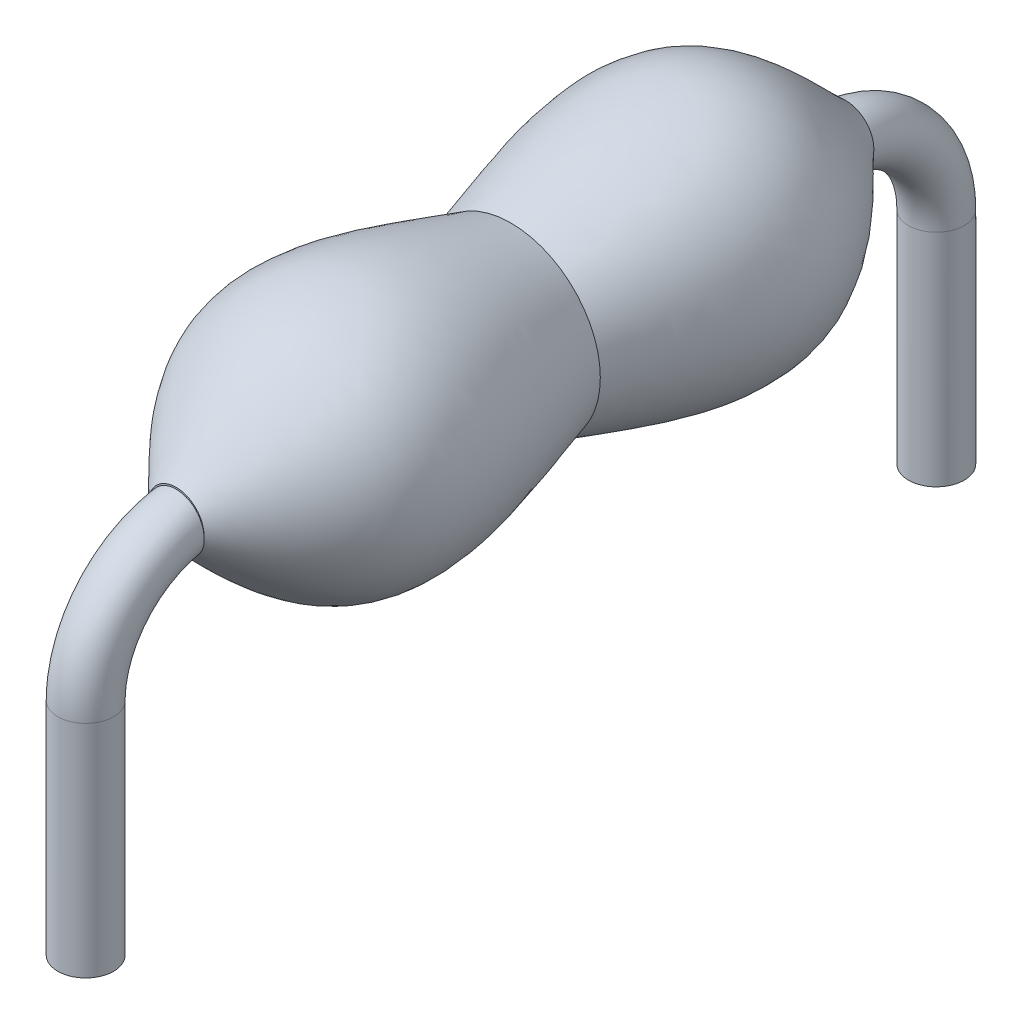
ISO-10303-21;
HEADER;
FILE_DESCRIPTION(('STEP AP214'),'2;1');
FILE_NAME('part.step','',(''),(''),'','','');
FILE_SCHEMA(('AUTOMOTIVE_DESIGN { 1 0 10303 214 1 1 1 1 }'));
ENDSEC;
DATA;
#1=APPLICATION_CONTEXT('core data for automotive mechanical design processes');
#2=APPLICATION_PROTOCOL_DEFINITION('international standard','automotive_design',2000,#1);
#3=PRODUCT_CONTEXT('',#1,'mechanical');
#4=PRODUCT('Part','Part','',(#3));
#5=PRODUCT_RELATED_PRODUCT_CATEGORY('part','',(#4));
#6=PRODUCT_DEFINITION_FORMATION('','',#4);
#7=PRODUCT_DEFINITION_CONTEXT('part definition',#1,'design');
#8=PRODUCT_DEFINITION('design','',#6,#7);
#9=PRODUCT_DEFINITION_SHAPE('','',#8);
#10=(LENGTH_UNIT() NAMED_UNIT(*) SI_UNIT(.MILLI.,.METRE.));
#11=(NAMED_UNIT(*) PLANE_ANGLE_UNIT() SI_UNIT($,.RADIAN.));
#12=(NAMED_UNIT(*) SI_UNIT($,.STERADIAN.) SOLID_ANGLE_UNIT());
#13=UNCERTAINTY_MEASURE_WITH_UNIT(LENGTH_MEASURE(1.E-05),#10,'distance_accuracy_value','');
#14=(GEOMETRIC_REPRESENTATION_CONTEXT(3) GLOBAL_UNCERTAINTY_ASSIGNED_CONTEXT((#13)) GLOBAL_UNIT_ASSIGNED_CONTEXT((#10,
#11,#12)) REPRESENTATION_CONTEXT('',''));
#15=CARTESIAN_POINT('',(0.,0.,0.));
#16=DIRECTION('',(0.,0.,1.));
#17=DIRECTION('',(1.,0.,0.));
#18=AXIS2_PLACEMENT_3D('',#15,#16,#17);
#19=CARTESIAN_POINT('',(0.,0.,-3.));
#20=DIRECTION('',(0.,0.,-1.));
#21=DIRECTION('',(1.,0.,0.));
#22=AXIS2_PLACEMENT_3D('',#19,#20,#21);
#23=PLANE('',#22);
#24=CARTESIAN_POINT('',(0.,0.,-3.));
#25=DIRECTION('',(0.,0.,1.));
#26=DIRECTION('',(1.,0.,0.));
#27=AXIS2_PLACEMENT_3D('',#24,#25,#26);
#28=CIRCLE('',#27,0.25);
#29=CARTESIAN_POINT('',(0.249837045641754,-0.0090249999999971,-3.));
#30=VERTEX_POINT('',#29);
#31=CARTESIAN_POINT('',(-0.249837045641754,-0.00902499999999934,-3.));
#32=VERTEX_POINT('',#31);
#33=EDGE_CURVE('E66',#30,#32,#28,.T.);
#34=ORIENTED_EDGE('',*,*,#33,.F.);
#35=CARTESIAN_POINT('',(-0.187387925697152,-0.187403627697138,-3.));
#36=CARTESIAN_POINT('',(-0.178201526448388,-0.198085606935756,-3.));
#37=CARTESIAN_POINT('',(-0.168126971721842,-0.208015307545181,-3.));
#38=CARTESIAN_POINT('',(-0.146457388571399,-0.22606669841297,-3.));
#39=CARTESIAN_POINT('',(-0.134860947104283,-0.234186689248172,-3.));
#40=CARTESIAN_POINT('',(-0.110449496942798,-0.248356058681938,-3.));
#41=CARTESIAN_POINT('',(-0.0976335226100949,-0.254403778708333,-3.));
#42=CARTESIAN_POINT('',(-0.0711554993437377,-0.264206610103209,-3.));
#43=CARTESIAN_POINT('',(-0.0574937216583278,-0.267962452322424,-3.));
#44=CARTESIAN_POINT('',(-0.0300151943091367,-0.272992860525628,-3.));
#45=CARTESIAN_POINT('',(-0.016207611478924,-0.274317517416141,-3.));
#46=CARTESIAN_POINT('',(0.011430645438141,-0.274590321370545,-3.));
#47=CARTESIAN_POINT('',(0.0252613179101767,-0.273538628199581,-3.));
#48=CARTESIAN_POINT('',(0.0523347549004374,-0.269131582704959,-3.));
#49=CARTESIAN_POINT('',(0.0655832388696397,-0.265811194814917,-3.));
#50=CARTESIAN_POINT('',(0.0913447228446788,-0.257018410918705,-3.));
#51=CARTESIAN_POINT('',(0.103857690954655,-0.251545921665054,-3.));
#52=CARTESIAN_POINT('',(0.12795745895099,-0.23855204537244,-3.));
#53=CARTESIAN_POINT('',(0.139531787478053,-0.231007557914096,-3.));
#54=CARTESIAN_POINT('',(0.161294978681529,-0.214132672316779,-3.));
#55=CARTESIAN_POINT('',(0.17148365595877,-0.204802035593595,-3.));
#56=CARTESIAN_POINT('',(0.19049068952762,-0.18433911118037,-3.));
#57=CARTESIAN_POINT('',(0.19926243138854,-0.173163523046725,-3.));
#58=CARTESIAN_POINT('',(0.214859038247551,-0.149527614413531,-3.));
#59=CARTESIAN_POINT('',(0.221683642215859,-0.137067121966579,-3.));
#60=CARTESIAN_POINT('',(0.23335615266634,-0.110885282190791,-3.));
#61=CARTESIAN_POINT('',(0.238151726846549,-0.0971405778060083,-3.));
#62=CARTESIAN_POINT('',(0.24539056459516,-0.0690446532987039,-3.));
#63=CARTESIAN_POINT('',(0.247833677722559,-0.054693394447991,-3.));
#64=CARTESIAN_POINT('',(0.250305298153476,-0.0256558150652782,-3.));
#65=CARTESIAN_POINT('',(0.250312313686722,-0.0109676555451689,-3.));
#66=CARTESIAN_POINT('',(0.247845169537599,0.0181993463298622,-3.));
#67=CARTESIAN_POINT('',(0.245371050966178,0.0326781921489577,-3.));
#68=CARTESIAN_POINT('',(0.238018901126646,0.060920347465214,-3.));
#69=CARTESIAN_POINT('',(0.233155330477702,0.0746874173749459,-3.));
#70=CARTESIAN_POINT('',(0.221154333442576,0.101192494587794,-3.));
#71=CARTESIAN_POINT('',(0.214017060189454,0.113930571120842,-3.));
#72=CARTESIAN_POINT('',(0.19777438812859,0.137828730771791,-3.));
#73=CARTESIAN_POINT('',(0.188697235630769,0.149008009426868,-3.));
#74=CARTESIAN_POINT('',(0.168769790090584,0.169655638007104,-3.));
#75=CARTESIAN_POINT('',(0.157919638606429,0.179124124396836,-3.));
#76=CARTESIAN_POINT('',(0.134924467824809,0.195937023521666,-3.));
#77=CARTESIAN_POINT('',(0.122800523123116,0.203310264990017,-3.));
#78=CARTESIAN_POINT('',(0.0974763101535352,0.215890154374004,-3.));
#79=CARTESIAN_POINT('',(0.0842761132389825,0.221096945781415,-3.));
#80=CARTESIAN_POINT('',(0.0573316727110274,0.22913975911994,-3.));
#81=CARTESIAN_POINT('',(0.043595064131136,0.232001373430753,-3.));
#82=CARTESIAN_POINT('',(0.0158360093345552,0.235363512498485,-3.));
#83=CARTESIAN_POINT('',(0.00181357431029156,0.235864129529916,-3.));
#84=CARTESIAN_POINT('',(-0.0260363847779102,0.234493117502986,-3.));
#85=CARTESIAN_POINT('',(-0.0398645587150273,0.232634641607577,-3.));
#86=CARTESIAN_POINT('',(-0.067012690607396,0.22662379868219,-3.));
#87=CARTESIAN_POINT('',(-0.0803326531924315,0.222471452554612,-3.));
#88=CARTESIAN_POINT('',(-0.1060981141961,0.211993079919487,-3.));
#89=CARTESIAN_POINT('',(-0.118543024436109,0.205665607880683,-3.));
#90=CARTESIAN_POINT('',(-0.142203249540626,0.191024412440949,-3.));
#91=CARTESIAN_POINT('',(-0.153418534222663,0.182710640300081,-3.));
#92=CARTESIAN_POINT('',(-0.174384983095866,0.164276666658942,-3.));
#93=CARTESIAN_POINT('',(-0.184125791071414,0.154144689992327,-3.));
#94=CARTESIAN_POINT('',(-0.20179175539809,0.132405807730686,-3.));
#95=CARTESIAN_POINT('',(-0.209716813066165,0.120798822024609,-3.));
#96=CARTESIAN_POINT('',(-0.223628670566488,0.0962945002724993,-3.));
#97=CARTESIAN_POINT('',(-0.229591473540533,0.0833835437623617,-3.));
#98=CARTESIAN_POINT('',(-0.239299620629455,0.056754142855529,-3.));
#99=CARTESIAN_POINT('',(-0.243044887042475,0.0430356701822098,-3.));
#100=CARTESIAN_POINT('',(-0.248269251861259,0.014968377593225,-3.));
#101=CARTESIAN_POINT('',(-0.249714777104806,0.000613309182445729,-3.));
#102=CARTESIAN_POINT('',(-0.250208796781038,-0.02814178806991,-3.));
#103=CARTESIAN_POINT('',(-0.249256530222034,-0.0425418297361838,-3.));
#104=CARTESIAN_POINT('',(-0.244960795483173,-0.071177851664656,-3.));
#105=CARTESIAN_POINT('',(-0.241585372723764,-0.085409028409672,-3.));
#106=CARTESIAN_POINT('',(-0.2325056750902,-0.113096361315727,-3.));
#107=CARTESIAN_POINT('',(-0.226803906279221,-0.126553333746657,-3.));
#108=CARTESIAN_POINT('',(-0.215502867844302,-0.148006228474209,-3.));
#109=CARTESIAN_POINT('',(-0.210505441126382,-0.156324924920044,-3.));
#110=CARTESIAN_POINT('',(-0.199608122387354,-0.172348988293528,-3.));
#111=CARTESIAN_POINT('',(-0.193708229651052,-0.180054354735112,-3.));
#112=CARTESIAN_POINT('',(-0.187387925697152,-0.187403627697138,-3.));
#113=B_SPLINE_CURVE_WITH_KNOTS('',3,(#35,#36,#37,#38,#39,#40,#41,#42,#43,#44,#45,#46,#47,#48,
#49,#50,#51,#52,#53,#54,#55,#56,#57,#58,#59,#60,#61,#62,#63,#64,#65,#66,#67,#68,#69,#70,#71,#72,
#73,#74,#75,#76,#77,#78,#79,#80,#81,#82,#83,#84,#85,#86,#87,#88,#89,#90,#91,#92,#93,#94,#95,#96,
#97,#98,#99,#100,#101,#102,#103,#104,#105,#106,#107,#108,#109,#110,#111,#112),.UNSPECIFIED.,.T.,
.F.,(4,2,2,2,2,2,2,2,2,2,2,2,2,2,2,2,2,2,2,2,2,2,2,2,2,2,2,2,2,2,2,2,2,2,2,2,2,2,4),(0.,
0.0422323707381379,0.0845042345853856,0.126809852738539,0.169101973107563,0.210512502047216,
0.251920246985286,0.292703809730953,0.333489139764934,0.374749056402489,0.416014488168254,
0.458440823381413,0.500872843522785,0.544340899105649,0.587811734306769,0.63166606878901,
0.675519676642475,0.719111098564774,0.762699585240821,0.805692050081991,0.848681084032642,
0.891046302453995,0.933408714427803,0.975302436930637,1.01719452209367,1.05885405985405,
1.10051321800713,1.14220011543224,1.18388803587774,1.22585637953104,1.26782700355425,
1.31029331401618,1.35276111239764,1.39584337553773,1.4389393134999,1.48261425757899,
1.526242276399,1.55529840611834,1.58435455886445),.UNSPECIFIED.);
#114=EDGE_CURVE('E50',#30,#32,#113,.T.);
#115=ORIENTED_EDGE('',*,*,#114,.T.);
#116=EDGE_LOOP('',(#34,#115));
#117=FACE_BOUND('',#116,.T.);
#118=ADVANCED_FACE('F31',(#117),#23,.T.);
#119=CARTESIAN_POINT('',(-0.537293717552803,0.592718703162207,0.));
#120=CARTESIAN_POINT('',(-0.534870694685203,0.875530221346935,-0.710765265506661));
#121=CARTESIAN_POINT('',(-0.530900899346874,1.33887865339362,-1.8752580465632));
#122=CARTESIAN_POINT('',(-0.284994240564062,0.493013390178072,-2.68463726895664));
#123=CARTESIAN_POINT('',(-0.189180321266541,0.163434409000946,-3.));
#124=CARTESIAN_POINT('',(-1.72273112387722,-0.4818687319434,0.));
#125=CARTESIAN_POINT('',(-2.28593113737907,-0.194211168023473,-0.710765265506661));
#126=CARTESIAN_POINT('',(-3.20865820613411,0.27707685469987,-1.8752580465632));
#127=CARTESIAN_POINT('',(-1.27102102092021,-0.0769750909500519,-2.68463726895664));
#128=CARTESIAN_POINT('',(-0.516049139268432,-0.214926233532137,-3.));
#129=CARTESIAN_POINT('',(-0.64814368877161,-1.66730613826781,0.));
#130=CARTESIAN_POINT('',(-1.21618974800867,-1.94527161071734,-0.710765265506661));
#131=CARTESIAN_POINT('',(-2.14685640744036,-2.40068045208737,-1.8752580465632));
#132=CARTESIAN_POINT('',(-0.701032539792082,-1.0630018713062,-2.68463726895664));
#133=CARTESIAN_POINT('',(-0.13768849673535,-0.541795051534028,-3.));
#134=CARTESIAN_POINT('',(0.537293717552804,-0.592718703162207,0.));
#135=CARTESIAN_POINT('',(0.534870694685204,-0.875530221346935,-0.710765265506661));
#136=CARTESIAN_POINT('',(0.530900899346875,-1.33887865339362,-1.8752580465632));
#137=CARTESIAN_POINT('',(0.284994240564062,-0.493013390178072,-2.68463726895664));
#138=CARTESIAN_POINT('',(0.189180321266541,-0.163434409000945,-3.));
#139=CARTESIAN_POINT('',(1.72273112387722,0.4818687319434,0.));
#140=CARTESIAN_POINT('',(2.28593113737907,0.194211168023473,-0.710765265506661));
#141=CARTESIAN_POINT('',(3.20865820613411,-0.277076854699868,-1.8752580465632));
#142=CARTESIAN_POINT('',(1.27102102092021,0.0769750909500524,-2.68463726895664));
#143=CARTESIAN_POINT('',(0.516049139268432,0.214926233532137,-3.));
#144=CARTESIAN_POINT('',(0.64814368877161,1.66730613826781,0.));
#145=CARTESIAN_POINT('',(1.21618974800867,1.94527161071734,-0.710765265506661));
#146=CARTESIAN_POINT('',(2.14685640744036,2.40068045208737,-1.8752580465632));
#147=CARTESIAN_POINT('',(0.701032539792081,1.0630018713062,-2.68463726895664));
#148=CARTESIAN_POINT('',(0.13768849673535,0.541795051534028,-3.));
#149=CARTESIAN_POINT('',(-0.537293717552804,0.592718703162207,0.));
#150=CARTESIAN_POINT('',(-0.534870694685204,0.875530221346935,-0.710765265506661));
#151=CARTESIAN_POINT('',(-0.530900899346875,1.33887865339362,-1.8752580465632));
#152=CARTESIAN_POINT('',(-0.284994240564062,0.493013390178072,-2.68463726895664));
#153=CARTESIAN_POINT('',(-0.189180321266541,0.163434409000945,-3.));
#154=(BOUNDED_SURFACE() B_SPLINE_SURFACE(3,3,((#119,#120,#121,#122,#123),(#124,#125,#126,#127,
#128),(#129,#130,#131,#132,#133),(#134,#135,#136,#137,#138),(#139,#140,#141,#142,#143),(#144,
#145,#146,#147,#148),(#149,#150,#151,#152,#153)),.UNSPECIFIED.,.T.,.F.,
.F.) B_SPLINE_SURFACE_WITH_KNOTS((4,3,4),(4,1,4),(0.,0.5,1.),(0.,0.610364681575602,1.),
.UNSPECIFIED.) GEOMETRIC_REPRESENTATION_ITEM() RATIONAL_B_SPLINE_SURFACE(((1.,1.,1.,1.,1.),
(0.333333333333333,0.333333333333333,0.333333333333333,0.333333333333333,0.333333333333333),
(0.333333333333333,0.333333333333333,0.333333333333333,0.333333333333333,0.333333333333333),(1.,
1.,1.,1.,1.),(0.333333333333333,0.333333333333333,0.333333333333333,0.333333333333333,
0.333333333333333),(0.333333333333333,0.333333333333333,0.333333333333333,0.333333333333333,
0.333333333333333),(1.,1.,1.,1.,1.))) REPRESENTATION_ITEM('') SURFACE());
#155=CARTESIAN_POINT('',(0.,0.,0.));
#156=DIRECTION('',(0.,0.,1.));
#157=DIRECTION('',(1.,0.,0.));
#158=AXIS2_PLACEMENT_3D('',#155,#156,#157);
#159=CIRCLE('',#158,0.8);
#160=CARTESIAN_POINT('',(0.8,0.,0.));
#161=VERTEX_POINT('',#160);
#162=EDGE_CURVE('E71',#161,#161,#159,.T.);
#163=CARTESIAN_POINT('',(-0.249837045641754,-0.00902499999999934,-3.));
#164=CARTESIAN_POINT('',(-0.250358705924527,-0.0232229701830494,-2.9988791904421));
#165=CARTESIAN_POINT('',(-0.249656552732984,-0.0374599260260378,-2.99775702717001));
#166=CARTESIAN_POINT('',(-0.245876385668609,-0.0656079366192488,-2.99553775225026));
#167=CARTESIAN_POINT('',(-0.242799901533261,-0.0795191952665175,-2.99444062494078));
#168=CARTESIAN_POINT('',(-0.23434147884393,-0.106637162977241,-2.99229719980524));
#169=CARTESIAN_POINT('',(-0.228958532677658,-0.119843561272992,-2.99125092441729));
#170=CARTESIAN_POINT('',(-0.216059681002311,-0.14515575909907,-2.98923847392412));
#171=CARTESIAN_POINT('',(-0.208544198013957,-0.157261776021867,-2.98827228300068));
#172=CARTESIAN_POINT('',(-0.183082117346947,-0.191373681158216,-2.98553701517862));
#173=CARTESIAN_POINT('',(-0.162179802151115,-0.211299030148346,-2.9839213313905));
#174=CARTESIAN_POINT('',(-0.115078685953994,-0.242875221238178,-2.98134049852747));
#175=CARTESIAN_POINT('',(-0.0889161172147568,-0.254580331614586,-2.98037108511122));
#176=CARTESIAN_POINT('',(-0.0344091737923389,-0.268509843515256,-2.97921536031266));
#177=CARTESIAN_POINT('',(-0.00608762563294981,-0.27082234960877,-2.9790217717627));
#178=CARTESIAN_POINT('',(0.0495365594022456,-0.26591824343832,-2.97942995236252));
#179=CARTESIAN_POINT('',(0.0768442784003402,-0.258758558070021,-2.98002697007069));
#180=CARTESIAN_POINT('',(0.127609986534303,-0.235876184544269,-2.98191324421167));
#181=CARTESIAN_POINT('',(0.151060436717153,-0.220136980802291,-2.98320383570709));
#182=CARTESIAN_POINT('',(0.191691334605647,-0.181671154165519,-2.98631794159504));
#183=CARTESIAN_POINT('',(0.208818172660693,-0.158887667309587,-2.98814578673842));
#184=CARTESIAN_POINT('',(0.228241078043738,-0.121472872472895,-2.99112182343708));
#185=CARTESIAN_POINT('',(0.23368478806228,-0.108368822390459,-2.99216013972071));
#186=CARTESIAN_POINT('',(0.242305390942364,-0.0814296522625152,-2.99428978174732));
#187=CARTESIAN_POINT('',(0.245484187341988,-0.0675951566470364,-2.99538106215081));
#188=CARTESIAN_POINT('',(0.248533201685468,-0.0462223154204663,-2.99706618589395));
#189=CARTESIAN_POINT('',(0.249256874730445,-0.0387940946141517,-2.99765171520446));
#190=CARTESIAN_POINT('',(0.250042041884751,-0.0239162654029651,-2.99882485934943));
#191=CARTESIAN_POINT('',(0.250104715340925,-0.016466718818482,-2.99941246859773));
#192=CARTESIAN_POINT('',(0.249837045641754,-0.00902499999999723,-3.));
#193=B_SPLINE_CURVE_WITH_KNOTS('',3,(#163,#164,#165,#166,#167,#168,#169,#170,#171,#172,#173,
#174,#175,#176,#177,#178,#179,#180,#181,#182,#183,#184,#185,#186,#187,#188,#189,#190,#191,#192),
.UNSPECIFIED.,.F.,.F.,(4,2,2,2,2,2,2,2,2,2,2,2,2,2,4),(0.,0.0426957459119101,0.0853640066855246,
0.128050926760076,0.170729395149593,0.255708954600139,0.340122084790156,0.423741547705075,
0.506860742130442,0.59014050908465,0.67411091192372,0.7166324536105,0.759118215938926,
0.781551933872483,0.803945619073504),.UNSPECIFIED.);
#194=EDGE_CURVE('E11',#32,#30,#193,.T.);
#195=ORIENTED_EDGE('',*,*,#162,.F.);
#196=EDGE_LOOP('',(#195));
#197=FACE_BOUND('',#196,.T.);
#198=ORIENTED_EDGE('',*,*,#33,.T.);
#199=ORIENTED_EDGE('',*,*,#194,.T.);
#200=EDGE_LOOP('',(#198,#199));
#201=FACE_BOUND('',#200,.T.);
#202=ADVANCED_FACE('F70',(#197,#201),#154,.F.);
#203=CARTESIAN_POINT('',(0.,0.,3.));
#204=DIRECTION('',(0.,0.,1.));
#205=DIRECTION('',(1.,0.,0.));
#206=AXIS2_PLACEMENT_3D('',#203,#204,#205);
#207=PLANE('',#206);
#208=CARTESIAN_POINT('',(-0.170610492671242,-0.205127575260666,3.));
#209=CARTESIAN_POINT('',(-0.160529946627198,-0.214803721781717,3.));
#210=CARTESIAN_POINT('',(-0.149644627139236,-0.22365373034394,3.));
#211=CARTESIAN_POINT('',(-0.126543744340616,-0.239423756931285,3.));
#212=CARTESIAN_POINT('',(-0.114327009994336,-0.246342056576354,3.));
#213=CARTESIAN_POINT('',(-0.0888868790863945,-0.258018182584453,3.));
#214=CARTESIAN_POINT('',(-0.0756627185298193,-0.262774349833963,3.));
#215=CARTESIAN_POINT('',(-0.0485971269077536,-0.269947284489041,3.));
#216=CARTESIAN_POINT('',(-0.0347558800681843,-0.272364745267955,3.));
#217=CARTESIAN_POINT('',(-0.00713167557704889,-0.274749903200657,3.));
#218=CARTESIAN_POINT('',(0.00664731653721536,-0.274763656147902,3.));
#219=CARTESIAN_POINT('',(0.0340079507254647,-0.272456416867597,3.));
#220=CARTESIAN_POINT('',(0.0475895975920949,-0.270135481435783,3.));
#221=CARTESIAN_POINT('',(0.0740605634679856,-0.263270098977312,3.));
#222=CARTESIAN_POINT('',(0.0869545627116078,-0.25874364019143,3.));
#223=CARTESIAN_POINT('',(0.11181940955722,-0.247627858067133,3.));
#224=CARTESIAN_POINT('',(0.123790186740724,-0.241038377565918,3.));
#225=CARTESIAN_POINT('',(0.146706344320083,-0.225867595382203,3.));
#226=CARTESIAN_POINT('',(0.157629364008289,-0.217252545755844,3.));
#227=CARTESIAN_POINT('',(0.177925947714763,-0.198358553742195,3.));
#228=CARTESIAN_POINT('',(0.187299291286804,-0.188079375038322,3.));
#229=CARTESIAN_POINT('',(0.204515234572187,-0.165827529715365,3.));
#230=CARTESIAN_POINT('',(0.212305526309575,-0.15381437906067,3.));
#231=CARTESIAN_POINT('',(0.225807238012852,-0.128671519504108,3.));
#232=CARTESIAN_POINT('',(0.2315184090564,-0.115541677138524,3.));
#233=CARTESIAN_POINT('',(0.240810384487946,-0.0882432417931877,3.));
#234=CARTESIAN_POINT('',(0.244344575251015,-0.0740587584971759,3.));
#235=CARTESIAN_POINT('',(0.248993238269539,-0.0452981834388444,3.));
#236=CARTESIAN_POINT('',(0.250107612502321,-0.0307220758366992,3.));
#237=CARTESIAN_POINT('',(0.249875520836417,-0.00152640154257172,3.));
#238=CARTESIAN_POINT('',(0.248518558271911,0.0130930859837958,3.));
#239=CARTESIAN_POINT('',(0.243347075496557,0.0418912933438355,3.));
#240=CARTESIAN_POINT('',(0.239532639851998,0.0560700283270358,3.));
#241=CARTESIAN_POINT('',(0.229584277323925,0.0834470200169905,3.));
#242=CARTESIAN_POINT('',(0.22347123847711,0.0966528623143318,3.));
#243=CARTESIAN_POINT('',(0.209083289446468,0.121829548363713,3.));
#244=CARTESIAN_POINT('',(0.200808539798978,0.133800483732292,3.));
#245=CARTESIAN_POINT('',(0.182460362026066,0.155981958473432,3.));
#246=CARTESIAN_POINT('',(0.172414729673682,0.166215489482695,3.));
#247=CARTESIAN_POINT('',(0.150726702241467,0.184821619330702,3.));
#248=CARTESIAN_POINT('',(0.139084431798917,0.193194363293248,3.));
#249=CARTESIAN_POINT('',(0.114708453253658,0.207720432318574,3.));
#250=CARTESIAN_POINT('',(0.101992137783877,0.213902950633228,3.));
#251=CARTESIAN_POINT('',(0.0756950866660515,0.224021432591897,3.));
#252=CARTESIAN_POINT('',(0.0621144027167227,0.227957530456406,3.));
#253=CARTESIAN_POINT('',(0.0346156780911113,0.233436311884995,3.));
#254=CARTESIAN_POINT('',(0.0207021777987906,0.235001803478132,3.));
#255=CARTESIAN_POINT('',(-0.00718940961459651,0.235764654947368,3.));
#256=CARTESIAN_POINT('',(-0.021167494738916,0.234962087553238,3.));
#257=CARTESIAN_POINT('',(-0.0487346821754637,0.231020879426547,3.));
#258=CARTESIAN_POINT('',(-0.0623250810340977,0.227891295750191,3.));
#259=CARTESIAN_POINT('',(-0.0887893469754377,0.21940010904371,3.));
#260=CARTESIAN_POINT('',(-0.10166321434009,0.214038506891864,3.));
#261=CARTESIAN_POINT('',(-0.12636445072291,0.201226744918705,3.));
#262=CARTESIAN_POINT('',(-0.138189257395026,0.193771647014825,3.));
#263=CARTESIAN_POINT('',(-0.160432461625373,0.176997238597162,3.));
#264=CARTESIAN_POINT('',(-0.170850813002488,0.167677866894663,3.));
#265=CARTESIAN_POINT('',(-0.190080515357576,0.147360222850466,3.));
#266=CARTESIAN_POINT('',(-0.198877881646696,0.136348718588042,3.));
#267=CARTESIAN_POINT('',(-0.214526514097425,0.113020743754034,3.));
#268=CARTESIAN_POINT('',(-0.221377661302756,0.100704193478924,3.));
#269=CARTESIAN_POINT('',(-0.233035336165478,0.074947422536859,3.));
#270=CARTESIAN_POINT('',(-0.23781440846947,0.0614947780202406,3.));
#271=CARTESIAN_POINT('',(-0.245082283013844,0.0339852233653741,3.));
#272=CARTESIAN_POINT('',(-0.247570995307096,0.0199282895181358,3.));
#273=CARTESIAN_POINT('',(-0.250224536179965,-0.00860997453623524,3.));
#274=CARTESIAN_POINT('',(-0.250354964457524,-0.0230945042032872,3.));
#275=CARTESIAN_POINT('',(-0.248211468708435,-0.0518885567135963,3.));
#276=CARTESIAN_POINT('',(-0.245936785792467,-0.0661980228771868,3.));
#277=CARTESIAN_POINT('',(-0.239009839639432,-0.0944093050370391,3.));
#278=CARTESIAN_POINT('',(-0.234329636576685,-0.108304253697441,3.));
#279=CARTESIAN_POINT('',(-0.222707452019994,-0.135101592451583,3.));
#280=CARTESIAN_POINT('',(-0.215767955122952,-0.148005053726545,3.));
#281=CARTESIAN_POINT('',(-0.202474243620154,-0.168382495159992,3.));
#282=CARTESIAN_POINT('',(-0.196692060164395,-0.176235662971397,3.));
#283=CARTESIAN_POINT('',(-0.18427377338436,-0.191235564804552,3.));
#284=CARTESIAN_POINT('',(-0.177637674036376,-0.198382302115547,3.));
#285=CARTESIAN_POINT('',(-0.170610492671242,-0.205127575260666,3.));
#286=B_SPLINE_CURVE_WITH_KNOTS('',3,(#208,#209,#210,#211,#212,#213,#214,#215,#216,#217,#218,
#219,#220,#221,#222,#223,#224,#225,#226,#227,#228,#229,#230,#231,#232,#233,#234,#235,#236,#237,
#238,#239,#240,#241,#242,#243,#244,#245,#246,#247,#248,#249,#250,#251,#252,#253,#254,#255,#256,
#257,#258,#259,#260,#261,#262,#263,#264,#265,#266,#267,#268,#269,#270,#271,#272,#273,#274,#275,
#276,#277,#278,#279,#280,#281,#282,#283,#284,#285),.UNSPECIFIED.,.T.,.F.,(4,2,2,2,2,2,2,2,2,2,2,
2,2,2,2,2,2,2,2,2,2,2,2,2,2,2,2,2,2,2,2,2,2,2,2,2,2,2,4),(0.,0.0418848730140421,
0.0838068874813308,0.125761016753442,0.167702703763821,0.208840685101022,0.24997766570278,
0.290784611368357,0.331594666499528,0.373140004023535,0.414691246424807,0.457448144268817,
0.500210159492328,0.543858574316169,0.587508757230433,0.631344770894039,0.675179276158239,
0.718624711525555,0.762066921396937,0.804879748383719,0.84768923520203,0.889904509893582,
0.932117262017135,0.973921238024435,1.0157239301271,1.05736476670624,1.09900558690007,
1.14074546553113,1.1824867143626,1.22457274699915,1.2666613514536,1.30929175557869,
1.35192383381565,1.3951772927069,1.43844440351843,1.48222581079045,1.52595923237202,
1.55515744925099,1.58435553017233),.UNSPECIFIED.);
#287=CARTESIAN_POINT('',(0.249848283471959,-0.00901177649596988,3.));
#288=VERTEX_POINT('',#287);
#289=CARTESIAN_POINT('',(-0.249847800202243,-0.00901228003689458,2.9999999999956));
#290=VERTEX_POINT('',#289);
#291=EDGE_CURVE('E72',#288,#290,#286,.T.);
#292=ORIENTED_EDGE('',*,*,#291,.F.);
#293=CARTESIAN_POINT('',(-0.189180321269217,0.16343440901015,2.99999999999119));
#294=CARTESIAN_POINT('',(0.137688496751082,0.541795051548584,2.99999999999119));
#295=CARTESIAN_POINT('',(0.516049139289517,0.214926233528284,2.99999999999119));
#296=CARTESIAN_POINT('',(0.189180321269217,-0.16343440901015,2.99999999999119));
#297=CARTESIAN_POINT('',(-0.137688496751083,-0.541795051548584,2.99999999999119));
#298=CARTESIAN_POINT('',(-0.516049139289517,-0.214926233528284,2.99999999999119));
#299=CARTESIAN_POINT('',(-0.189180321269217,0.16343440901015,2.99999999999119));
#300=(BOUNDED_CURVE() B_SPLINE_CURVE(3,(#293,#294,#295,#296,#297,#298,#299),.UNSPECIFIED.,.T.,
.F.) B_SPLINE_CURVE_WITH_KNOTS((4,3,4),(0.,0.5,1.),
.UNSPECIFIED.) CURVE() GEOMETRIC_REPRESENTATION_ITEM() RATIONAL_B_SPLINE_CURVE((1.,
0.333333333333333,0.333333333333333,1.,0.333333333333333,0.333333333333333,1.)) REPRESENTATION_ITEM(''));
#301=EDGE_CURVE('E75',#288,#290,#300,.F.);
#302=ORIENTED_EDGE('',*,*,#301,.T.);
#303=EDGE_LOOP('',(#292,#302));
#304=FACE_BOUND('',#303,.T.);
#305=ADVANCED_FACE('F133',(#304),#207,.T.);
#306=CARTESIAN_POINT('',(-0.537293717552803,0.592718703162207,0.));
#307=CARTESIAN_POINT('',(-0.534870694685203,0.875530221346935,0.710765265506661));
#308=CARTESIAN_POINT('',(-0.530900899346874,1.33887865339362,1.8752580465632));
#309=CARTESIAN_POINT('',(-0.284994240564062,0.493013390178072,2.68463726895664));
#310=CARTESIAN_POINT('',(-0.189180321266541,0.163434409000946,3.));
#311=CARTESIAN_POINT('',(-1.72273112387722,-0.4818687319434,0.));
#312=CARTESIAN_POINT('',(-2.28593113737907,-0.194211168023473,0.710765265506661));
#313=CARTESIAN_POINT('',(-3.20865820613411,0.27707685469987,1.8752580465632));
#314=CARTESIAN_POINT('',(-1.27102102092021,-0.0769750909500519,2.68463726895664));
#315=CARTESIAN_POINT('',(-0.516049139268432,-0.214926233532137,3.));
#316=CARTESIAN_POINT('',(-0.64814368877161,-1.66730613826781,0.));
#317=CARTESIAN_POINT('',(-1.21618974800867,-1.94527161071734,0.710765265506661));
#318=CARTESIAN_POINT('',(-2.14685640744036,-2.40068045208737,1.8752580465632));
#319=CARTESIAN_POINT('',(-0.701032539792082,-1.0630018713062,2.68463726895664));
#320=CARTESIAN_POINT('',(-0.13768849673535,-0.541795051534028,3.));
#321=CARTESIAN_POINT('',(0.537293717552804,-0.592718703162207,0.));
#322=CARTESIAN_POINT('',(0.534870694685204,-0.875530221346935,0.710765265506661));
#323=CARTESIAN_POINT('',(0.530900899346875,-1.33887865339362,1.8752580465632));
#324=CARTESIAN_POINT('',(0.284994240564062,-0.493013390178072,2.68463726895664));
#325=CARTESIAN_POINT('',(0.189180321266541,-0.163434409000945,3.));
#326=CARTESIAN_POINT('',(1.72273112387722,0.4818687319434,0.));
#327=CARTESIAN_POINT('',(2.28593113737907,0.194211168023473,0.710765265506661));
#328=CARTESIAN_POINT('',(3.20865820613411,-0.277076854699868,1.8752580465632));
#329=CARTESIAN_POINT('',(1.27102102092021,0.0769750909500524,2.68463726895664));
#330=CARTESIAN_POINT('',(0.516049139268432,0.214926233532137,3.));
#331=CARTESIAN_POINT('',(0.64814368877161,1.66730613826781,0.));
#332=CARTESIAN_POINT('',(1.21618974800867,1.94527161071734,0.710765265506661));
#333=CARTESIAN_POINT('',(2.14685640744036,2.40068045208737,1.8752580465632));
#334=CARTESIAN_POINT('',(0.701032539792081,1.0630018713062,2.68463726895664));
#335=CARTESIAN_POINT('',(0.13768849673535,0.541795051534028,3.));
#336=CARTESIAN_POINT('',(-0.537293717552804,0.592718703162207,0.));
#337=CARTESIAN_POINT('',(-0.534870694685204,0.875530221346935,0.710765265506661));
#338=CARTESIAN_POINT('',(-0.530900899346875,1.33887865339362,1.8752580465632));
#339=CARTESIAN_POINT('',(-0.284994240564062,0.493013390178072,2.68463726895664));
#340=CARTESIAN_POINT('',(-0.189180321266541,0.163434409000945,3.));
#341=(BOUNDED_SURFACE() B_SPLINE_SURFACE(3,3,((#306,#307,#308,#309,#310),(#311,#312,#313,#314,
#315),(#316,#317,#318,#319,#320),(#321,#322,#323,#324,#325),(#326,#327,#328,#329,#330),(#331,
#332,#333,#334,#335),(#336,#337,#338,#339,#340)),.UNSPECIFIED.,.T.,.F.,
.F.) B_SPLINE_SURFACE_WITH_KNOTS((4,3,4),(4,1,4),(0.,0.5,1.),(0.,0.610364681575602,1.),
.UNSPECIFIED.) GEOMETRIC_REPRESENTATION_ITEM() RATIONAL_B_SPLINE_SURFACE(((1.,1.,1.,1.,1.),
(0.333333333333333,0.333333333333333,0.333333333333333,0.333333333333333,0.333333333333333),
(0.333333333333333,0.333333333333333,0.333333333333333,0.333333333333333,0.333333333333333),(1.,
1.,1.,1.,1.),(0.333333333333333,0.333333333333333,0.333333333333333,0.333333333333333,
0.333333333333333),(0.333333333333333,0.333333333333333,0.333333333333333,0.333333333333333,
0.333333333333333),(1.,1.,1.,1.,1.))) REPRESENTATION_ITEM('') SURFACE());
#342=CARTESIAN_POINT('',(-0.249837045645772,-0.00902500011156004,2.99999999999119));
#343=CARTESIAN_POINT('',(-0.250358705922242,-0.0232229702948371,2.99887919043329));
#344=CARTESIAN_POINT('',(-0.249656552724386,-0.0374599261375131,2.99775702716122));
#345=CARTESIAN_POINT('',(-0.245876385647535,-0.065607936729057,2.99553775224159));
#346=CARTESIAN_POINT('',(-0.242799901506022,-0.0795191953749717,2.99444062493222));
#347=CARTESIAN_POINT('',(-0.234341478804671,-0.106637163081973,2.99229719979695));
#348=CARTESIAN_POINT('',(-0.228958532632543,-0.119843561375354,2.99125092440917));
#349=CARTESIAN_POINT('',(-0.216059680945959,-0.145155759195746,2.98923847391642));
#350=CARTESIAN_POINT('',(-0.208544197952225,-0.157261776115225,2.98827228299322));
#351=CARTESIAN_POINT('',(-0.183082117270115,-0.191373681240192,2.985537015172));
#352=CARTESIAN_POINT('',(-0.162179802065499,-0.211299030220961,2.9839213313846));
#353=CARTESIAN_POINT('',(-0.115078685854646,-0.242875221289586,2.98134049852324));
#354=CARTESIAN_POINT('',(-0.0889161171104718,-0.254580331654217,2.98037108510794));
#355=CARTESIAN_POINT('',(-0.0344091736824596,-0.268509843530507,2.97921536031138));
#356=CARTESIAN_POINT('',(-0.00608762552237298,-0.270822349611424,2.97902177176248));
#357=CARTESIAN_POINT('',(0.0495365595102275,-0.265918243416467,2.97942995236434));
#358=CARTESIAN_POINT('',(0.0768442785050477,-0.258758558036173,2.98002697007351));
#359=CARTESIAN_POINT('',(0.127609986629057,-0.23587618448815,2.98191324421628));
#360=CARTESIAN_POINT('',(0.151060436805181,-0.220136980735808,2.98320383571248));
#361=CARTESIAN_POINT('',(0.191691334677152,-0.181671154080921,2.98631794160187));
#362=CARTESIAN_POINT('',(0.208818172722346,-0.158887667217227,2.98814578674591));
#363=CARTESIAN_POINT('',(0.228241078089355,-0.121472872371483,2.99112182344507));
#364=CARTESIAN_POINT('',(0.233684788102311,-0.108368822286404,2.9921601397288));
#365=CARTESIAN_POINT('',(0.242305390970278,-0.0814296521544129,2.994289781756));
#366=CARTESIAN_POINT('',(0.245484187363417,-0.0675951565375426,2.99538106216));
#367=CARTESIAN_POINT('',(0.248533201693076,-0.0462223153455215,2.99706618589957));
#368=CARTESIAN_POINT('',(0.249256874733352,-0.0387940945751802,2.99765171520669));
#369=CARTESIAN_POINT('',(0.250042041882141,-0.0239162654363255,2.99882485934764));
#370=CARTESIAN_POINT('',(0.250104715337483,-0.0164667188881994,2.99941246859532));
#371=CARTESIAN_POINT('',(0.249837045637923,-0.00902500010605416,3.));
#372=B_SPLINE_CURVE_WITH_KNOTS('',3,(#342,#343,#344,#345,#346,#347,#348,#349,#350,#351,#352,
#353,#354,#355,#356,#357,#358,#359,#360,#361,#362,#363,#364,#365,#366,#367,#368,#369,#370,#371),
.UNSPECIFIED.,.F.,.F.,(4,2,2,2,2,2,2,2,2,2,2,2,2,2,4),(0.,0.0426957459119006,0.0853640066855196,
0.128050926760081,0.170729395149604,0.25570895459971,0.34012208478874,0.423741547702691,
0.506860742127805,0.590140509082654,0.674110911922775,0.716632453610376,0.759118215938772,
0.781551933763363,0.803945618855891),.UNSPECIFIED.);
#373=EDGE_CURVE('E43',#290,#288,#372,.T.);
#374=ORIENTED_EDGE('',*,*,#373,.F.);
#375=ORIENTED_EDGE('',*,*,#301,.F.);
#376=EDGE_LOOP('',(#374,#375));
#377=FACE_BOUND('',#376,.T.);
#378=ORIENTED_EDGE('',*,*,#162,.T.);
#379=EDGE_LOOP('',(#378));
#380=FACE_BOUND('',#379,.T.);
#381=ADVANCED_FACE('F33',(#377,#380),#341,.T.);
#382=CARTESIAN_POINT('',(0.,-1.,3.81));
#383=DIRECTION('',(0.,-1.,0.));
#384=DIRECTION('',(0.,0.,-1.));
#385=AXIS2_PLACEMENT_3D('',#382,#383,#384);
#386=CYLINDRICAL_SURFACE('',#385,0.25);
#387=CARTESIAN_POINT('',(0.,-1.,3.81));
#388=DIRECTION('',(0.,-1.,0.));
#389=DIRECTION('',(1.,0.,0.));
#390=AXIS2_PLACEMENT_3D('',#387,#388,#389);
#391=CIRCLE('',#390,0.25);
#392=CARTESIAN_POINT('',(0.25,-1.,3.81));
#393=VERTEX_POINT('',#392);
#394=EDGE_CURVE('E67',#393,#393,#391,.T.);
#395=ORIENTED_EDGE('',*,*,#394,.T.);
#396=EDGE_LOOP('',(#395));
#397=FACE_BOUND('',#396,.T.);
#398=CARTESIAN_POINT('',(0.,-2.97515605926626,3.81));
#399=DIRECTION('',(0.,-1.,0.));
#400=DIRECTION('',(1.,0.,0.));
#401=AXIS2_PLACEMENT_3D('',#398,#399,#400);
#402=CIRCLE('',#401,0.25);
#403=CARTESIAN_POINT('',(0.25,-2.97515605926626,3.81));
#404=VERTEX_POINT('',#403);
#405=EDGE_CURVE('E78',#404,#404,#402,.T.);
#406=ORIENTED_EDGE('',*,*,#405,.F.);
#407=EDGE_LOOP('',(#406));
#408=FACE_BOUND('',#407,.T.);
#409=ADVANCED_FACE('F113',(#397,#408),#386,.T.);
#410=CARTESIAN_POINT('',(0.,-1.,2.81));
#411=DIRECTION('',(1.,0.,0.));
#412=DIRECTION('',(0.,0.,-1.));
#413=AXIS2_PLACEMENT_3D('',#410,#411,#412);
#414=TOROIDAL_SURFACE('',#413,1.,0.25);
#415=ORIENTED_EDGE('',*,*,#373,.T.);
#416=ORIENTED_EDGE('',*,*,#291,.T.);
#417=EDGE_LOOP('',(#415,#416));
#418=FACE_BOUND('',#417,.T.);
#419=ORIENTED_EDGE('',*,*,#394,.F.);
#420=EDGE_LOOP('',(#419));
#421=FACE_BOUND('',#420,.T.);
#422=ADVANCED_FACE('F116',(#418,#421),#414,.T.);
#423=CARTESIAN_POINT('',(0.,-2.97515605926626,3.81));
#424=DIRECTION('',(0.,-1.,0.));
#425=DIRECTION('',(1.,0.,0.));
#426=AXIS2_PLACEMENT_3D('',#423,#424,#425);
#427=PLANE('',#426);
#428=ORIENTED_EDGE('',*,*,#405,.T.);
#429=EDGE_LOOP('',(#428));
#430=FACE_BOUND('',#429,.T.);
#431=ADVANCED_FACE('F120',(#430),#427,.T.);
#432=CARTESIAN_POINT('',(0.,-1.,-3.81));
#433=DIRECTION('',(0.,-1.,0.));
#434=DIRECTION('',(0.,0.,-1.));
#435=AXIS2_PLACEMENT_3D('',#432,#433,#434);
#436=CYLINDRICAL_SURFACE('',#435,0.25);
#437=CARTESIAN_POINT('',(0.,-1.,-3.81));
#438=DIRECTION('',(0.,1.,0.));
#439=DIRECTION('',(0.,0.,1.));
#440=AXIS2_PLACEMENT_3D('',#437,#438,#439);
#441=CIRCLE('',#440,0.25);
#442=CARTESIAN_POINT('',(0.,-1.,-3.56));
#443=VERTEX_POINT('',#442);
#444=EDGE_CURVE('E169',#443,#443,#441,.T.);
#445=ORIENTED_EDGE('',*,*,#444,.F.);
#446=EDGE_LOOP('',(#445));
#447=FACE_BOUND('',#446,.T.);
#448=CARTESIAN_POINT('',(0.,-2.97515605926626,-3.81));
#449=DIRECTION('',(0.,-1.,0.));
#450=DIRECTION('',(0.,0.,-1.));
#451=AXIS2_PLACEMENT_3D('',#448,#449,#450);
#452=CIRCLE('',#451,0.25);
#453=CARTESIAN_POINT('',(0.,-2.97515605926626,-4.06));
#454=VERTEX_POINT('',#453);
#455=EDGE_CURVE('E68',#454,#454,#452,.F.);
#456=ORIENTED_EDGE('',*,*,#455,.T.);
#457=EDGE_LOOP('',(#456));
#458=FACE_BOUND('',#457,.T.);
#459=ADVANCED_FACE('F101',(#447,#458),#436,.T.);
#460=CARTESIAN_POINT('',(0.,-1.,-2.81));
#461=DIRECTION('',(-1.,0.,0.));
#462=DIRECTION('',(0.,0.,1.));
#463=AXIS2_PLACEMENT_3D('',#460,#461,#462);
#464=TOROIDAL_SURFACE('',#463,1.,0.25);
#465=ORIENTED_EDGE('',*,*,#114,.F.);
#466=ORIENTED_EDGE('',*,*,#194,.F.);
#467=EDGE_LOOP('',(#465,#466));
#468=FACE_BOUND('',#467,.T.);
#469=ORIENTED_EDGE('',*,*,#444,.T.);
#470=EDGE_LOOP('',(#469));
#471=FACE_BOUND('',#470,.T.);
#472=ADVANCED_FACE('F60',(#468,#471),#464,.T.);
#473=CARTESIAN_POINT('',(0.,-2.97515605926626,-3.81));
#474=DIRECTION('',(0.,-1.,0.));
#475=DIRECTION('',(1.,0.,0.));
#476=AXIS2_PLACEMENT_3D('',#473,#474,#475);
#477=PLANE('',#476);
#478=ORIENTED_EDGE('',*,*,#455,.F.);
#479=EDGE_LOOP('',(#478));
#480=FACE_BOUND('',#479,.T.);
#481=ADVANCED_FACE('F100',(#480),#477,.T.);
#482=CLOSED_SHELL('',(#118,#202,#305,#381,#409,#422,#431,#459,#472,#481));
#483=MANIFOLD_SOLID_BREP('B2',#482);
#484=ADVANCED_BREP_SHAPE_REPRESENTATION('',(#18,#483),#14);
#485=SHAPE_DEFINITION_REPRESENTATION(#9,#484);
ENDSEC;
END-ISO-10303-21;
